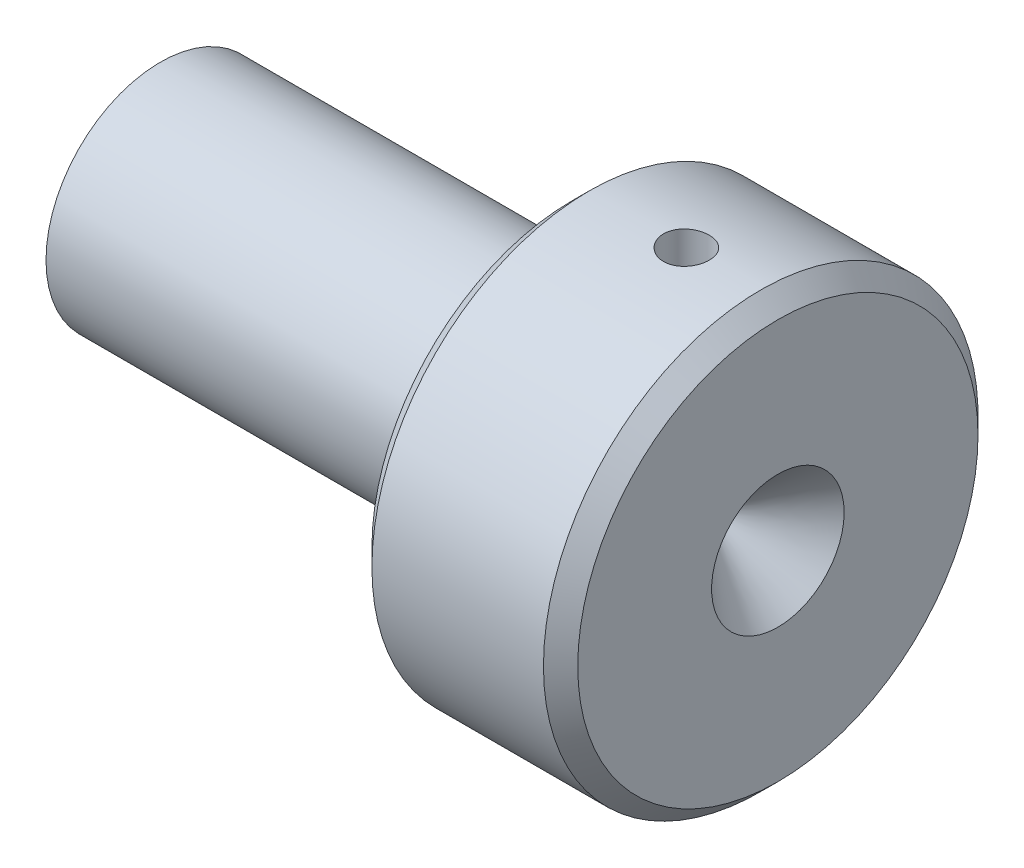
ISO-10303-21;
HEADER;
FILE_DESCRIPTION(('STEP AP214'),'2;1');
FILE_NAME('part.step','',(''),(''),'','','');
FILE_SCHEMA(('AUTOMOTIVE_DESIGN { 1 0 10303 214 1 1 1 1 }'));
ENDSEC;
DATA;
#1=APPLICATION_CONTEXT('core data for automotive mechanical design processes');
#2=APPLICATION_PROTOCOL_DEFINITION('international standard','automotive_design',2000,#1);
#3=PRODUCT_CONTEXT('',#1,'mechanical');
#4=PRODUCT('Part','Part','',(#3));
#5=PRODUCT_RELATED_PRODUCT_CATEGORY('part','',(#4));
#6=PRODUCT_DEFINITION_FORMATION('','',#4);
#7=PRODUCT_DEFINITION_CONTEXT('part definition',#1,'design');
#8=PRODUCT_DEFINITION('design','',#6,#7);
#9=PRODUCT_DEFINITION_SHAPE('','',#8);
#10=(LENGTH_UNIT() NAMED_UNIT(*) SI_UNIT(.MILLI.,.METRE.));
#11=(NAMED_UNIT(*) PLANE_ANGLE_UNIT() SI_UNIT($,.RADIAN.));
#12=(NAMED_UNIT(*) SI_UNIT($,.STERADIAN.) SOLID_ANGLE_UNIT());
#13=UNCERTAINTY_MEASURE_WITH_UNIT(LENGTH_MEASURE(1.E-05),#10,'distance_accuracy_value','');
#14=(GEOMETRIC_REPRESENTATION_CONTEXT(3) GLOBAL_UNCERTAINTY_ASSIGNED_CONTEXT((#13)) GLOBAL_UNIT_ASSIGNED_CONTEXT((#10,
#11,#12)) REPRESENTATION_CONTEXT('',''));
#15=CARTESIAN_POINT('',(0.,0.,0.));
#16=DIRECTION('',(0.,0.,1.));
#17=DIRECTION('',(1.,0.,0.));
#18=AXIS2_PLACEMENT_3D('',#15,#16,#17);
#19=CARTESIAN_POINT('',(-77.2950620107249,0.,0.));
#20=DIRECTION('',(-1.,0.,0.));
#21=DIRECTION('',(0.,0.,1.));
#22=AXIS2_PLACEMENT_3D('',#19,#20,#21);
#23=CYLINDRICAL_SURFACE('',#22,19.);
#24=CARTESIAN_POINT('',(-8.,18.8944436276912,2.));
#25=CARTESIAN_POINT('',(-8.11200647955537,18.894445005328,1.99999516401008));
#26=CARTESIAN_POINT('',(-8.22408624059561,18.8954503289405,1.9905592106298));
#27=CARTESIAN_POINT('',(-8.44513605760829,18.8993622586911,1.95306115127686));
#28=CARTESIAN_POINT('',(-8.5541025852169,18.9022709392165,1.92497872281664));
#29=CARTESIAN_POINT('',(-8.76569292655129,18.9096565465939,1.85101648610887));
#30=CARTESIAN_POINT('',(-8.86832062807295,18.914132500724,1.80514771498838));
#31=CARTESIAN_POINT('',(-9.06439918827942,18.9241471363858,1.69693653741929));
#32=CARTESIAN_POINT('',(-9.15785181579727,18.9296856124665,1.63459731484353));
#33=CARTESIAN_POINT('',(-9.33332404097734,18.9412261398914,1.49494626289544));
#34=CARTESIAN_POINT('',(-9.41530160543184,18.9472297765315,1.41758174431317));
#35=CARTESIAN_POINT('',(-9.56513447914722,18.9590098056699,1.25018900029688));
#36=CARTESIAN_POINT('',(-9.63298913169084,18.9647861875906,1.16016018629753));
#37=CARTESIAN_POINT('',(-9.75279657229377,18.9754766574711,0.969735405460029));
#38=CARTESIAN_POINT('',(-9.80471196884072,18.9803887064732,0.869315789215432));
#39=CARTESIAN_POINT('',(-9.89092794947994,18.9887797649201,0.661123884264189));
#40=CARTESIAN_POINT('',(-9.92522900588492,18.9922588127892,0.553351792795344));
#41=CARTESIAN_POINT('',(-9.97511882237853,18.9973807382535,0.333940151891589));
#42=CARTESIAN_POINT('',(-9.99077682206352,18.9990304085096,0.222316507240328));
#43=CARTESIAN_POINT('',(-10.0031503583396,19.0003308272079,-0.00198567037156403));
#44=CARTESIAN_POINT('',(-9.99986643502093,18.9999816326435,-0.114664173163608));
#45=CARTESIAN_POINT('',(-9.9745054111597,18.9973292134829,-0.337407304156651));
#46=CARTESIAN_POINT('',(-9.95250276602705,18.9950337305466,-0.447480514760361));
#47=CARTESIAN_POINT('',(-9.89044494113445,18.9887555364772,-0.662363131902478));
#48=CARTESIAN_POINT('',(-9.85038950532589,18.9847728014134,-0.767172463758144));
#49=CARTESIAN_POINT('',(-9.75328196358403,18.9755544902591,-0.968786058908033));
#50=CARTESIAN_POINT('',(-9.69619705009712,18.9703164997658,-1.0655744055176));
#51=CARTESIAN_POINT('',(-9.56667481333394,18.9591750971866,-1.24822489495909));
#52=CARTESIAN_POINT('',(-9.49423699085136,18.9532716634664,-1.33408668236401));
#53=CARTESIAN_POINT('',(-9.33564676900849,18.9414277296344,-1.49288310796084));
#54=CARTESIAN_POINT('',(-9.24942957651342,18.9354871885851,-1.56575304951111));
#55=CARTESIAN_POINT('',(-9.06595224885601,18.9242670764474,-1.69599602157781));
#56=CARTESIAN_POINT('',(-8.96869209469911,18.9189875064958,-1.75336902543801));
#57=CARTESIAN_POINT('',(-8.76583846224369,18.9096867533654,-1.85098996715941));
#58=CARTESIAN_POINT('',(-8.66024293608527,18.9056658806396,-1.89123368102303));
#59=CARTESIAN_POINT('',(-8.44374162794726,18.8993441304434,-1.9534012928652));
#60=CARTESIAN_POINT('',(-8.33283602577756,18.8970431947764,-1.97532581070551));
#61=CARTESIAN_POINT('',(-8.10943139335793,18.8944320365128,-2.00014898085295));
#62=CARTESIAN_POINT('',(-7.9969425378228,18.8941123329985,-2.0031382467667));
#63=CARTESIAN_POINT('',(-7.77306555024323,18.8954748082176,-1.99024424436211));
#64=CARTESIAN_POINT('',(-7.66167740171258,18.8971569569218,-1.97436125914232));
#65=CARTESIAN_POINT('',(-7.44342927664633,18.9023249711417,-1.9242495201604));
#66=CARTESIAN_POINT('',(-7.33655930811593,18.9058066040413,-1.89006381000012));
#67=CARTESIAN_POINT('',(-7.13007021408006,18.914177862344,-1.80436104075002));
#68=CARTESIAN_POINT('',(-7.03045127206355,18.9190675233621,-1.7528435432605));
#69=CARTESIAN_POINT('',(-6.84087961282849,18.9297268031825,-1.6337134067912));
#70=CARTESIAN_POINT('',(-6.75096473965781,18.9354996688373,-1.56604084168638));
#71=CARTESIAN_POINT('',(-6.58373779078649,18.947264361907,-1.41660720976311));
#72=CARTESIAN_POINT('',(-6.50642606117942,18.9532561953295,-1.334845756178));
#73=CARTESIAN_POINT('',(-6.36628639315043,18.9648124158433,-1.15916162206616));
#74=CARTESIAN_POINT('',(-6.30351765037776,18.9703749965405,-1.06519158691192));
#75=CARTESIAN_POINT('',(-6.19465350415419,18.9804195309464,-0.867990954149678));
#76=CARTESIAN_POINT('',(-6.14855785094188,18.9849015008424,-0.764760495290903));
#77=CARTESIAN_POINT('',(-6.07444818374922,18.9922716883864,-0.55217406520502));
#78=CARTESIAN_POINT('',(-6.0463987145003,18.9951630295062,-0.442830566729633));
#79=CARTESIAN_POINT('',(-6.00906199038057,18.9990390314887,-0.220953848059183));
#80=CARTESIAN_POINT('',(-5.99977414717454,19.00002375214,-0.108420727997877));
#81=CARTESIAN_POINT('',(-6.00023311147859,18.9999754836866,0.116060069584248));
#82=CARTESIAN_POINT('',(-6.00988814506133,18.9989522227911,0.228007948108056));
#83=CARTESIAN_POINT('',(-6.04776597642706,18.9950221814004,0.448681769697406));
#84=CARTESIAN_POINT('',(-6.07598878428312,18.9921153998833,0.557407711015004));
#85=CARTESIAN_POINT('',(-6.15017491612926,18.9847438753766,0.768548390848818));
#86=CARTESIAN_POINT('',(-6.19613521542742,18.980279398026,0.870964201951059));
#87=CARTESIAN_POINT('',(-6.30448201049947,18.9702895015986,1.06664262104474));
#88=CARTESIAN_POINT('',(-6.36686846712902,18.96476408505,1.15990525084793));
#89=CARTESIAN_POINT('',(-6.50664011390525,18.9532388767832,1.33510009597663));
#90=CARTESIAN_POINT('',(-6.58409367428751,18.947236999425,1.41697762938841));
#91=CARTESIAN_POINT('',(-6.75166399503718,18.9354528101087,1.56661295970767));
#92=CARTESIAN_POINT('',(-6.84178378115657,18.9296705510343,1.63436737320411));
#93=CARTESIAN_POINT('',(-7.03240672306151,18.9189630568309,1.75398534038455));
#94=CARTESIAN_POINT('',(-7.13293812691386,18.9140402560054,1.80580406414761));
#95=CARTESIAN_POINT('',(-7.3412645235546,18.9056379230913,1.89175492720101));
#96=CARTESIAN_POINT('',(-7.4490512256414,18.9021567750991,1.92590687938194));
#97=CARTESIAN_POINT('',(-7.63119886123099,18.897903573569,1.96710315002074));
#98=CARTESIAN_POINT('',(-7.70439803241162,18.8966122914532,1.97942244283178));
#99=CARTESIAN_POINT('',(-7.85172076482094,18.8948818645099,1.99587244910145));
#100=CARTESIAN_POINT('',(-7.92584432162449,18.8944427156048,2.00000320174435));
#101=CARTESIAN_POINT('',(-8.,18.8944436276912,2.));
#102=B_SPLINE_CURVE_WITH_KNOTS('',3,(#24,#25,#26,#27,#28,#29,#30,#31,#32,#33,#34,#35,#36,#37,
#38,#39,#40,#41,#42,#43,#44,#45,#46,#47,#48,#49,#50,#51,#52,#53,#54,#55,#56,#57,#58,#59,#60,#61,
#62,#63,#64,#65,#66,#67,#68,#69,#70,#71,#72,#73,#74,#75,#76,#77,#78,#79,#80,#81,#82,#83,#84,#85,
#86,#87,#88,#89,#90,#91,#92,#93,#94,#95,#96,#97,#98,#99,#100,#101),.UNSPECIFIED.,.T.,.F.,(4,2,2,
2,2,2,2,2,2,2,2,2,2,2,2,2,2,2,2,2,2,2,2,2,2,2,2,2,2,2,2,2,2,2,2,2,2,2,4),(0.,0.335748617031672,
0.671863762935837,1.00777066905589,1.34361268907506,1.68065439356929,2.01771176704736,
2.35555389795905,2.69338696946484,3.02996138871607,3.36652621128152,3.70175854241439,
4.03699562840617,4.37288277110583,4.70878083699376,5.04630752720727,5.38383479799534,
5.72144525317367,6.05904428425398,6.39502652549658,6.73100372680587,7.06619423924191,
7.40139323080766,7.73785548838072,8.07432698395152,8.41214488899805,8.74995773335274,
9.08710483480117,9.42424136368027,9.75974857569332,10.0952559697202,10.4307061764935,
10.7661555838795,11.1031642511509,11.4402535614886,11.7782826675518,12.115931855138,
12.3382206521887,12.5605083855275),.UNSPECIFIED.);
#103=CARTESIAN_POINT('',(-8.,18.8944436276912,2.));
#104=VERTEX_POINT('',#103);
#105=EDGE_CURVE('E13',#104,#104,#102,.T.);
#106=ORIENTED_EDGE('',*,*,#105,.T.);
#107=EDGE_LOOP('',(#106));
#108=FACE_BOUND('',#107,.T.);
#109=CARTESIAN_POINT('',(-1.5,0.,0.));
#110=DIRECTION('',(-1.,0.,0.));
#111=DIRECTION('',(0.,0.,1.));
#112=AXIS2_PLACEMENT_3D('',#109,#110,#111);
#113=CIRCLE('',#112,19.);
#114=CARTESIAN_POINT('',(-1.5,0.,19.));
#115=VERTEX_POINT('',#114);
#116=EDGE_CURVE('E84',#115,#115,#113,.T.);
#117=ORIENTED_EDGE('',*,*,#116,.T.);
#118=EDGE_LOOP('',(#117));
#119=FACE_BOUND('',#118,.T.);
#120=CARTESIAN_POINT('',(-16.5,0.,0.));
#121=DIRECTION('',(1.,0.,0.));
#122=DIRECTION('',(0.,0.,-1.));
#123=AXIS2_PLACEMENT_3D('',#120,#121,#122);
#124=CIRCLE('',#123,19.);
#125=CARTESIAN_POINT('',(-16.5,0.,-19.));
#126=VERTEX_POINT('',#125);
#127=EDGE_CURVE('E81',#126,#126,#124,.T.);
#128=ORIENTED_EDGE('',*,*,#127,.T.);
#129=EDGE_LOOP('',(#128));
#130=FACE_BOUND('',#129,.T.);
#131=ADVANCED_FACE('F48',(#108,#119,#130),#23,.T.);
#132=CARTESIAN_POINT('',(-18.,19.,0.));
#133=DIRECTION('',(1.,0.,0.));
#134=DIRECTION('',(0.,0.,-1.));
#135=AXIS2_PLACEMENT_3D('',#132,#133,#134);
#136=PLANE('',#135);
#137=CARTESIAN_POINT('',(-18.,0.,0.));
#138=DIRECTION('',(1.,0.,0.));
#139=DIRECTION('',(0.,0.,-1.));
#140=AXIS2_PLACEMENT_3D('',#137,#138,#139);
#141=CIRCLE('',#140,17.5);
#142=CARTESIAN_POINT('',(-18.,0.,-17.5));
#143=VERTEX_POINT('',#142);
#144=EDGE_CURVE('E90',#143,#143,#141,.F.);
#145=ORIENTED_EDGE('',*,*,#144,.T.);
#146=EDGE_LOOP('',(#145));
#147=FACE_BOUND('',#146,.T.);
#148=CARTESIAN_POINT('',(-18.,0.,0.));
#149=DIRECTION('',(-1.,0.,0.));
#150=DIRECTION('',(0.,0.,1.));
#151=AXIS2_PLACEMENT_3D('',#148,#149,#150);
#152=CIRCLE('',#151,10.);
#153=CARTESIAN_POINT('',(-18.,0.,10.));
#154=VERTEX_POINT('',#153);
#155=EDGE_CURVE('E78',#154,#154,#152,.T.);
#156=ORIENTED_EDGE('',*,*,#155,.F.);
#157=EDGE_LOOP('',(#156));
#158=FACE_BOUND('',#157,.T.);
#159=ADVANCED_FACE('F122',(#147,#158),#136,.F.);
#160=CARTESIAN_POINT('',(-77.2950620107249,0.,0.));
#161=DIRECTION('',(-1.,0.,0.));
#162=DIRECTION('',(0.,0.,1.));
#163=AXIS2_PLACEMENT_3D('',#160,#161,#162);
#164=CYLINDRICAL_SURFACE('',#163,10.);
#165=CARTESIAN_POINT('',(-54.,0.,0.));
#166=DIRECTION('',(-1.,0.,0.));
#167=DIRECTION('',(0.,0.,1.));
#168=AXIS2_PLACEMENT_3D('',#165,#166,#167);
#169=CIRCLE('',#168,9.99999999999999);
#170=CARTESIAN_POINT('',(-54.,0.,9.99999999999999));
#171=VERTEX_POINT('',#170);
#172=EDGE_CURVE('E73',#171,#171,#169,.T.);
#173=ORIENTED_EDGE('',*,*,#172,.F.);
#174=EDGE_LOOP('',(#173));
#175=FACE_BOUND('',#174,.T.);
#176=ORIENTED_EDGE('',*,*,#155,.T.);
#177=EDGE_LOOP('',(#176));
#178=FACE_BOUND('',#177,.T.);
#179=ADVANCED_FACE('F133',(#175,#178),#164,.T.);
#180=CARTESIAN_POINT('',(-54.,9.99999999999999,0.));
#181=DIRECTION('',(1.,0.,0.));
#182=DIRECTION('',(0.,0.,-1.));
#183=AXIS2_PLACEMENT_3D('',#180,#181,#182);
#184=PLANE('',#183);
#185=CARTESIAN_POINT('',(-54.,0.,0.));
#186=DIRECTION('',(-1.,0.,0.));
#187=DIRECTION('',(0.,0.,1.));
#188=AXIS2_PLACEMENT_3D('',#185,#186,#187);
#189=CIRCLE('',#188,3.35769091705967);
#190=CARTESIAN_POINT('',(-54.,0.,3.35769091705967));
#191=VERTEX_POINT('',#190);
#192=EDGE_CURVE('E70',#191,#191,#189,.T.);
#193=ORIENTED_EDGE('',*,*,#192,.F.);
#194=EDGE_LOOP('',(#193));
#195=FACE_BOUND('',#194,.T.);
#196=ORIENTED_EDGE('',*,*,#172,.T.);
#197=EDGE_LOOP('',(#196));
#198=FACE_BOUND('',#197,.T.);
#199=ADVANCED_FACE('F137',(#195,#198),#184,.F.);
#200=CARTESIAN_POINT('',(-54.,0.,0.));
#201=DIRECTION('',(-1.,0.,0.));
#202=DIRECTION('',(0.,0.,1.));
#203=AXIS2_PLACEMENT_3D('',#200,#201,#202);
#204=CONICAL_SURFACE('',#203,3.35769091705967,0.0436332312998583);
#205=CARTESIAN_POINT('',(-4.9952411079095,0.,0.));
#206=DIRECTION('',(1.,0.,0.));
#207=DIRECTION('',(0.,0.,-1.));
#208=AXIS2_PLACEMENT_3D('',#205,#206,#207);
#209=CIRCLE('',#208,1.2180969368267);
#210=CARTESIAN_POINT('',(-4.9952411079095,0.,-1.21809693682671));
#211=VERTEX_POINT('',#210);
#212=EDGE_CURVE('E58',#211,#211,#209,.T.);
#213=ORIENTED_EDGE('',*,*,#212,.T.);
#214=EDGE_LOOP('',(#213));
#215=FACE_BOUND('',#214,.T.);
#216=ORIENTED_EDGE('',*,*,#192,.T.);
#217=EDGE_LOOP('',(#216));
#218=FACE_BOUND('',#217,.T.);
#219=ADVANCED_FACE('F98',(#215,#218),#204,.F.);
#220=CARTESIAN_POINT('',(0.,19.,0.));
#221=DIRECTION('',(-1.,0.,0.));
#222=DIRECTION('',(0.,0.,1.));
#223=AXIS2_PLACEMENT_3D('',#220,#221,#222);
#224=PLANE('',#223);
#225=CARTESIAN_POINT('',(0.,0.,0.));
#226=DIRECTION('',(-1.,0.,0.));
#227=DIRECTION('',(0.,0.,1.));
#228=AXIS2_PLACEMENT_3D('',#225,#226,#227);
#229=CIRCLE('',#228,5.7953920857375);
#230=CARTESIAN_POINT('',(0.,0.,-5.7953920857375));
#231=VERTEX_POINT('',#230);
#232=EDGE_CURVE('E93',#231,#231,#229,.T.);
#233=ORIENTED_EDGE('',*,*,#232,.T.);
#234=EDGE_LOOP('',(#233));
#235=FACE_BOUND('',#234,.T.);
#236=CARTESIAN_POINT('',(0.,0.,0.));
#237=DIRECTION('',(-1.,0.,0.));
#238=DIRECTION('',(0.,0.,1.));
#239=AXIS2_PLACEMENT_3D('',#236,#237,#238);
#240=CIRCLE('',#239,17.5);
#241=CARTESIAN_POINT('',(0.,0.,17.5));
#242=VERTEX_POINT('',#241);
#243=EDGE_CURVE('E87',#242,#242,#240,.F.);
#244=ORIENTED_EDGE('',*,*,#243,.T.);
#245=EDGE_LOOP('',(#244));
#246=FACE_BOUND('',#245,.T.);
#247=ADVANCED_FACE('F108',(#235,#246),#224,.F.);
#248=CARTESIAN_POINT('',(-1.5,0.,0.));
#249=DIRECTION('',(-1.,0.,0.));
#250=DIRECTION('',(0.,0.,1.));
#251=AXIS2_PLACEMENT_3D('',#248,#249,#250);
#252=CONICAL_SURFACE('',#251,19.,0.785398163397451);
#253=ORIENTED_EDGE('',*,*,#243,.F.);
#254=EDGE_LOOP('',(#253));
#255=FACE_BOUND('',#254,.T.);
#256=ORIENTED_EDGE('',*,*,#116,.F.);
#257=EDGE_LOOP('',(#256));
#258=FACE_BOUND('',#257,.T.);
#259=ADVANCED_FACE('F111',(#255,#258),#252,.T.);
#260=CARTESIAN_POINT('',(-18.,0.,0.));
#261=DIRECTION('',(1.,0.,0.));
#262=DIRECTION('',(0.,0.,-1.));
#263=AXIS2_PLACEMENT_3D('',#260,#261,#262);
#264=CONICAL_SURFACE('',#263,17.5,0.785398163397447);
#265=ORIENTED_EDGE('',*,*,#127,.F.);
#266=EDGE_LOOP('',(#265));
#267=FACE_BOUND('',#266,.T.);
#268=ORIENTED_EDGE('',*,*,#144,.F.);
#269=EDGE_LOOP('',(#268));
#270=FACE_BOUND('',#269,.T.);
#271=ADVANCED_FACE('F104',(#267,#270),#264,.T.);
#272=CARTESIAN_POINT('',(0.,0.,0.));
#273=DIRECTION('',(1.,0.,0.));
#274=DIRECTION('',(0.,0.,-1.));
#275=AXIS2_PLACEMENT_3D('',#272,#273,#274);
#276=CONICAL_SURFACE('',#275,5.7953920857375,0.741764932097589);
#277=CARTESIAN_POINT('',(-4.9952411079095,0.,-1.21809693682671));
#278=CARTESIAN_POINT('',(-4.94320734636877,0.,-1.26577709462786));
#279=CARTESIAN_POINT('',(-4.89117358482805,0.,-1.31345725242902));
#280=CARTESIAN_POINT('',(-4.7871060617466,0.,-1.40881756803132));
#281=CARTESIAN_POINT('',(-4.73507230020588,0.,-1.45649772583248));
#282=CARTESIAN_POINT('',(-4.63100477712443,0.,-1.55185804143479));
#283=CARTESIAN_POINT('',(-4.57897101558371,0.,-1.59953819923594));
#284=CARTESIAN_POINT('',(-4.47490349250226,0.,-1.69489851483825));
#285=CARTESIAN_POINT('',(-4.42286973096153,0.,-1.7425786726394));
#286=CARTESIAN_POINT('',(-4.31880220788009,0.,-1.83793898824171));
#287=CARTESIAN_POINT('',(-4.26676844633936,0.,-1.88561914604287));
#288=CARTESIAN_POINT('',(-4.16270092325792,0.,-1.98097946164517));
#289=CARTESIAN_POINT('',(-4.11066716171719,0.,-2.02865961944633));
#290=CARTESIAN_POINT('',(-4.00659963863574,0.,-2.12401993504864));
#291=CARTESIAN_POINT('',(-3.95456587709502,0.,-2.17170009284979));
#292=CARTESIAN_POINT('',(-3.85049835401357,0.,-2.2670604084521));
#293=CARTESIAN_POINT('',(-3.79846459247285,0.,-2.31474056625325));
#294=CARTESIAN_POINT('',(-3.6943970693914,0.,-2.41010088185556));
#295=CARTESIAN_POINT('',(-3.64236330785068,0.,-2.45778103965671));
#296=CARTESIAN_POINT('',(-3.53829578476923,0.,-2.55314135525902));
#297=CARTESIAN_POINT('',(-3.4862620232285,0.,-2.60082151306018));
#298=CARTESIAN_POINT('',(-3.38219450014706,0.,-2.69618182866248));
#299=CARTESIAN_POINT('',(-3.33016073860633,0.,-2.74386198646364));
#300=CARTESIAN_POINT('',(-3.22609321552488,0.,-2.83922230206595));
#301=CARTESIAN_POINT('',(-3.17405945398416,0.,-2.8869024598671));
#302=CARTESIAN_POINT('',(-3.06999193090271,0.,-2.98226277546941));
#303=CARTESIAN_POINT('',(-3.01795816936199,0.,-3.02994293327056));
#304=CARTESIAN_POINT('',(-2.91389064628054,0.,-3.12530324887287));
#305=CARTESIAN_POINT('',(-2.86185688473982,0.,-3.17298340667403));
#306=CARTESIAN_POINT('',(-2.75778936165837,0.,-3.26834372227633));
#307=CARTESIAN_POINT('',(-2.70575560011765,0.,-3.31602388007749));
#308=CARTESIAN_POINT('',(-2.6016880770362,0.,-3.4113841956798));
#309=CARTESIAN_POINT('',(-2.54965431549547,0.,-3.45906435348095));
#310=CARTESIAN_POINT('',(-2.44558679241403,0.,-3.55442466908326));
#311=CARTESIAN_POINT('',(-2.3935530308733,0.,-3.60210482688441));
#312=CARTESIAN_POINT('',(-2.28948550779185,0.,-3.69746514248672));
#313=CARTESIAN_POINT('',(-2.23745174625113,0.,-3.74514530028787));
#314=CARTESIAN_POINT('',(-2.13338422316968,0.,-3.84050561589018));
#315=CARTESIAN_POINT('',(-2.08135046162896,0.,-3.88818577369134));
#316=CARTESIAN_POINT('',(-1.97728293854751,0.,-3.98354608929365));
#317=CARTESIAN_POINT('',(-1.92524917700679,0.,-4.0312262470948));
#318=CARTESIAN_POINT('',(-1.82118165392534,0.,-4.12658656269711));
#319=CARTESIAN_POINT('',(-1.76914789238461,0.,-4.17426672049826));
#320=CARTESIAN_POINT('',(-1.66508036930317,0.,-4.26962703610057));
#321=CARTESIAN_POINT('',(-1.61304660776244,0.,-4.31730719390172));
#322=CARTESIAN_POINT('',(-1.50897908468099,0.,-4.41266750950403));
#323=CARTESIAN_POINT('',(-1.45694532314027,0.,-4.46034766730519));
#324=CARTESIAN_POINT('',(-1.35287780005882,0.,-4.55570798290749));
#325=CARTESIAN_POINT('',(-1.3008440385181,0.,-4.60338814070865));
#326=CARTESIAN_POINT('',(-1.19677651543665,0.,-4.69874845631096));
#327=CARTESIAN_POINT('',(-1.14474275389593,0.,-4.74642861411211));
#328=CARTESIAN_POINT('',(-1.04067523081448,0.,-4.84178892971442));
#329=CARTESIAN_POINT('',(-0.988641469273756,0.,-4.88946908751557));
#330=CARTESIAN_POINT('',(-0.884573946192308,0.,-4.98482940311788));
#331=CARTESIAN_POINT('',(-0.832540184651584,0.,-5.03250956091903));
#332=CARTESIAN_POINT('',(-0.728472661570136,0.,-5.12786987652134));
#333=CARTESIAN_POINT('',(-0.676438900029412,0.,-5.1755500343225));
#334=CARTESIAN_POINT('',(-0.572371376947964,0.,-5.27091034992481));
#335=CARTESIAN_POINT('',(-0.52033761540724,0.,-5.31859050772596));
#336=CARTESIAN_POINT('',(-0.416270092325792,0.,-5.41395082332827));
#337=CARTESIAN_POINT('',(-0.364236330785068,0.,-5.46163098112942));
#338=CARTESIAN_POINT('',(-0.26016880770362,0.,-5.55699129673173));
#339=CARTESIAN_POINT('',(-0.208135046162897,0.,-5.60467145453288));
#340=CARTESIAN_POINT('',(-0.104067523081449,0.,-5.70003177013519));
#341=CARTESIAN_POINT('',(-0.052033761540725,0.,-5.74771192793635));
#342=CARTESIAN_POINT('',(0.,0.,-5.7953920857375));
#343=B_SPLINE_CURVE_WITH_KNOTS('',3,(#277,#278,#279,#280,#281,#282,#283,#284,#285,#286,#287,
#288,#289,#290,#291,#292,#293,#294,#295,#296,#297,#298,#299,#300,#301,#302,#303,#304,#305,#306,
#307,#308,#309,#310,#311,#312,#313,#314,#315,#316,#317,#318,#319,#320,#321,#322,#323,#324,#325,
#326,#327,#328,#329,#330,#331,#332,#333,#334,#335,#336,#337,#338,#339,#340,#341,#342),
.UNSPECIFIED.,.F.,.F.,(4,2,2,2,2,2,2,2,2,2,2,2,2,2,2,2,2,2,2,2,2,2,2,2,2,2,2,2,2,2,2,2,4),(0.,
0.211726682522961,0.423453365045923,0.635180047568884,0.846906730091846,1.05863341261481,
1.27036009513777,1.48208677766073,1.69381346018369,1.90554014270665,2.11726682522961,
2.32899350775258,2.54072019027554,2.7524468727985,2.96417355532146,3.17590023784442,
3.38762692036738,3.59935360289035,3.81108028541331,4.02280696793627,4.23453365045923,
4.44626033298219,4.65798701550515,4.86971369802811,5.08144038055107,5.29316706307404,
5.504893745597,5.71662042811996,5.92834711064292,6.14007379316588,6.35180047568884,
6.56352715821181,6.77525384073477),.UNSPECIFIED.);
#344=EDGE_CURVE('BSEAM101',#211,#231,#343,.T.);
#345=ORIENTED_EDGE('',*,*,#212,.F.);
#346=ORIENTED_EDGE('',*,*,#232,.F.);
#347=ORIENTED_EDGE('',*,*,#344,.T.);
#348=ORIENTED_EDGE('',*,*,#344,.F.);
#349=EDGE_LOOP('',(#345,#347,#346,#348));
#350=FACE_BOUND('',#349,.T.);
#351=ADVANCED_FACE('F101',(#350),#276,.F.);
#352=CARTESIAN_POINT('',(-8.,19.,0.));
#353=DIRECTION('',(0.,1.,0.));
#354=DIRECTION('',(0.,0.,1.));
#355=AXIS2_PLACEMENT_3D('',#352,#353,#354);
#356=CYLINDRICAL_SURFACE('',#355,2.);
#357=CARTESIAN_POINT('',(-8.,13.,0.));
#358=DIRECTION('',(0.,1.,0.));
#359=DIRECTION('',(0.,0.,1.));
#360=AXIS2_PLACEMENT_3D('',#357,#358,#359);
#361=CIRCLE('',#360,2.);
#362=CARTESIAN_POINT('',(-8.,13.,2.));
#363=VERTEX_POINT('',#362);
#364=EDGE_CURVE('E68',#363,#363,#361,.T.);
#365=ORIENTED_EDGE('',*,*,#364,.F.);
#366=EDGE_LOOP('',(#365));
#367=FACE_BOUND('',#366,.T.);
#368=ORIENTED_EDGE('',*,*,#105,.F.);
#369=EDGE_LOOP('',(#368));
#370=FACE_BOUND('',#369,.T.);
#371=ADVANCED_FACE('F64',(#367,#370),#356,.F.);
#372=CARTESIAN_POINT('',(-8.,13.,0.));
#373=DIRECTION('',(0.,1.,0.));
#374=DIRECTION('',(0.,0.,1.));
#375=AXIS2_PLACEMENT_3D('',#372,#373,#374);
#376=CONICAL_SURFACE('',#375,2.,1.02974425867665);
#377=CARTESIAN_POINT('',(-8.,11.7982787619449,0.));
#378=VERTEX_POINT('',#377);
#379=VERTEX_LOOP('',#378);
#380=FACE_BOUND('',#379,.T.);
#381=ORIENTED_EDGE('',*,*,#364,.T.);
#382=EDGE_LOOP('',(#381));
#383=FACE_BOUND('',#382,.T.);
#384=ADVANCED_FACE('F61',(#380,#383),#376,.F.);
#385=CLOSED_SHELL('',(#131,#159,#179,#199,#219,#247,#259,#271,#351,#371,#384));
#386=MANIFOLD_SOLID_BREP('B2',#385);
#387=ADVANCED_BREP_SHAPE_REPRESENTATION('',(#18,#386),#14);
#388=SHAPE_DEFINITION_REPRESENTATION(#9,#387);
ENDSEC;
END-ISO-10303-21;
